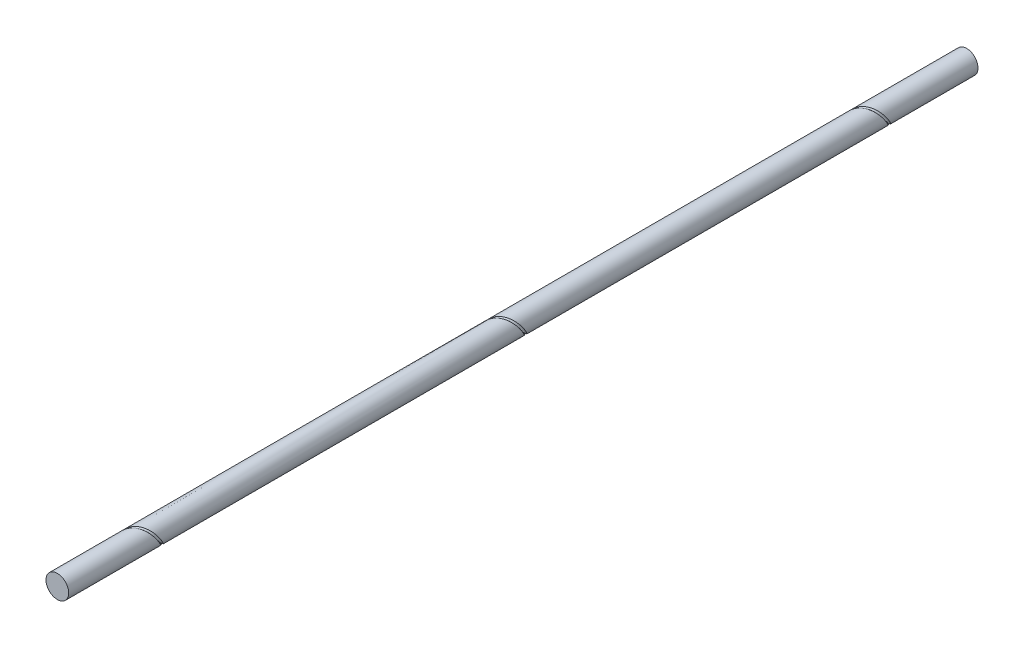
from build123d import *

# Parameters (mm, degrees)
SKETCH1_R              = 25
BOSS_EXTRUDE1_DEPTH    = 2000
CUT_SWEEP1_PITCH       = 100
CUT_SWEEP1_HEIGHT      = 100
CUT_SWEEP1_RADIUS      = 27.646
CUT_SWEEP1_START_ANGLE = -180
SKETCH3_R              = 3.969
LPATTERN1_COUNT        = 3
LPATTERN1_PITCH        = 800


with BuildPart() as part:
    # Sketch1 → Boss-Extrude1 (new body)
    with BuildSketch(Plane.XY):
        Circle(SKETCH1_R)
    extrude(amount=BOSS_EXTRUDE1_DEPTH)

    # Cut-Sweep1: sweep along a helix
    with BuildLine() as cut_sweep1_path:
        add(Helix(CUT_SWEEP1_PITCH, CUT_SWEEP1_HEIGHT, CUT_SWEEP1_RADIUS, center=(0, 0, 150), direction=(0, 0, 1), mode=Mode.PRIVATE).rotate(Axis((0, 0, 150), (0, 0, 1)), CUT_SWEEP1_START_ANGLE))
    # Sketch3 → Cut-Sweep1 (sweep, cut)
    with BuildSketch(Plane(origin=(0, 0, 0), x_dir=(1, 0, 0), z_dir=(0, 1, 0))):
        with Locations((-27.646, -150)):
            Circle(SKETCH3_R)
    cut_sweep1 = sweep(path=cut_sweep1_path.line, is_frenet=True, mode=Mode.SUBTRACT)

    # LPattern1: Cut-Sweep1 ×3
    with Locations(*[(0, 0, i * LPATTERN1_PITCH) for i in range(1, LPATTERN1_COUNT)]):
        add(cut_sweep1, mode=Mode.SUBTRACT)


solid = part.part
